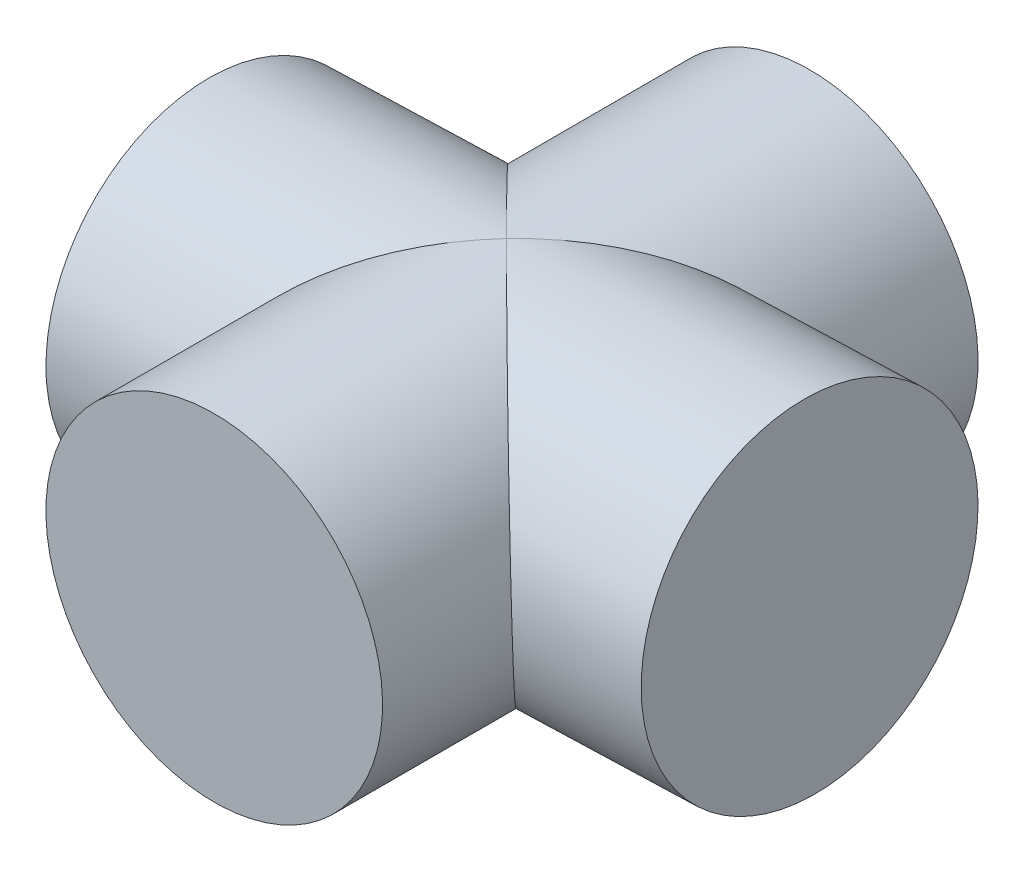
ISO-10303-21;
HEADER;
FILE_DESCRIPTION(('STEP AP214'),'2;1');
FILE_NAME('part.step','',(''),(''),'','','');
FILE_SCHEMA(('AUTOMOTIVE_DESIGN { 1 0 10303 214 1 1 1 1 }'));
ENDSEC;
DATA;
#1=APPLICATION_CONTEXT('core data for automotive mechanical design processes');
#2=APPLICATION_PROTOCOL_DEFINITION('international standard','automotive_design',2000,#1);
#3=PRODUCT_CONTEXT('',#1,'mechanical');
#4=PRODUCT('Part','Part','',(#3));
#5=PRODUCT_RELATED_PRODUCT_CATEGORY('part','',(#4));
#6=PRODUCT_DEFINITION_FORMATION('','',#4);
#7=PRODUCT_DEFINITION_CONTEXT('part definition',#1,'design');
#8=PRODUCT_DEFINITION('design','',#6,#7);
#9=PRODUCT_DEFINITION_SHAPE('','',#8);
#10=(LENGTH_UNIT() NAMED_UNIT(*) SI_UNIT(.MILLI.,.METRE.));
#11=(NAMED_UNIT(*) PLANE_ANGLE_UNIT() SI_UNIT($,.RADIAN.));
#12=(NAMED_UNIT(*) SI_UNIT($,.STERADIAN.) SOLID_ANGLE_UNIT());
#13=UNCERTAINTY_MEASURE_WITH_UNIT(LENGTH_MEASURE(1.E-05),#10,'distance_accuracy_value','');
#14=(GEOMETRIC_REPRESENTATION_CONTEXT(3) GLOBAL_UNCERTAINTY_ASSIGNED_CONTEXT((#13)) GLOBAL_UNIT_ASSIGNED_CONTEXT((#10,
#11,#12)) REPRESENTATION_CONTEXT('',''));
#15=CARTESIAN_POINT('',(0.,0.,0.));
#16=DIRECTION('',(0.,0.,1.));
#17=DIRECTION('',(1.,0.,0.));
#18=AXIS2_PLACEMENT_3D('',#15,#16,#17);
#19=CARTESIAN_POINT('',(8.99728163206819,-776.108673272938,37.6201291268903));
#20=DIRECTION('',(-0.999465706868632,-0.0326848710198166,-7.07598383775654E-08));
#21=DIRECTION('',(-7.07976652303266E-08,0.,0.999999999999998));
#22=AXIS2_PLACEMENT_3D('',#19,#20,#21);
#23=CYLINDRICAL_SURFACE('',#22,6.5);
#24=DIRECTION('',(-0.999465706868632,-0.0326848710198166,-7.07598383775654E-08));
#25=VECTOR('',#24,1.);
#26=CARTESIAN_POINT('',(8.99728117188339,-776.108673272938,44.1201291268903));
#27=LINE('',#26,#25);
#28=CARTESIAN_POINT('',(8.99728117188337,-776.108673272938,44.1201291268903));
#29=VERTEX_POINT('',#28);
#30=CARTESIAN_POINT('',(6.49861690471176,-776.190385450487,44.1201289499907));
#31=VERTEX_POINT('',#30);
#32=EDGE_CURVE('E95',#29,#31,#27,.T.);
#33=ORIENTED_EDGE('',*,*,#32,.F.);
#34=ORIENTED_EDGE('',*,*,#32,.T.);
#35=CARTESIAN_POINT('',(0.21454193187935,-782.899364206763,37.6201285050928));
#36=CARTESIAN_POINT('',(4.02011912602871,-782.77491290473,41.4277406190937));
#37=CARTESIAN_POINT('',(6.62306820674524,-779.995962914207,44.1201289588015));
#38=CARTESIAN_POINT('',(6.49861690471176,-776.190385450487,44.1201289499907));
#39=(BOUNDED_CURVE() B_SPLINE_CURVE(3,(#35,#36,#37,#38),.UNSPECIFIED.,.F.,
.F.) B_SPLINE_CURVE_WITH_KNOTS((4,4),(1.5707963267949,3.1415926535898),
.UNSPECIFIED.) CURVE() GEOMETRIC_REPRESENTATION_ITEM() RATIONAL_B_SPLINE_CURVE((1.,
0.804737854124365,0.804737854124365,1.)) REPRESENTATION_ITEM(''));
#40=CARTESIAN_POINT('',(0.21454193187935,-782.899364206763,37.6201285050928));
#41=VERTEX_POINT('',#40);
#42=EDGE_CURVE('E87',#41,#31,#39,.T.);
#43=ORIENTED_EDGE('',*,*,#42,.F.);
#44=CARTESIAN_POINT('',(6.49861782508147,-776.190385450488,31.1201289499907));
#45=CARTESIAN_POINT('',(6.62306912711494,-779.995962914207,31.1201289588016));
#46=CARTESIAN_POINT('',(4.02011966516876,-782.774912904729,33.8125169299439));
#47=CARTESIAN_POINT('',(0.21454193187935,-782.899364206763,37.6201285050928));
#48=(BOUNDED_CURVE() B_SPLINE_CURVE(3,(#44,#45,#46,#47),.UNSPECIFIED.,.F.,
.F.) B_SPLINE_CURVE_WITH_KNOTS((4,4),(3.1415926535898,4.71238898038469),
.UNSPECIFIED.) CURVE() GEOMETRIC_REPRESENTATION_ITEM() RATIONAL_B_SPLINE_CURVE((1.,
0.804737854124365,0.804737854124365,1.)) REPRESENTATION_ITEM(''));
#49=CARTESIAN_POINT('',(6.49861782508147,-776.190385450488,31.1201289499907));
#50=VERTEX_POINT('',#49);
#51=EDGE_CURVE('E66',#50,#41,#48,.T.);
#52=ORIENTED_EDGE('',*,*,#51,.F.);
#53=DIRECTION('',(-0.999465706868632,-0.0326848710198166,-7.07598383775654E-08));
#54=VECTOR('',#53,1.);
#55=CARTESIAN_POINT('',(8.99728209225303,-776.108673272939,31.1201291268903));
#56=LINE('',#55,#54);
#57=CARTESIAN_POINT('',(8.99728209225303,-776.108673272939,31.1201291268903));
#58=VERTEX_POINT('',#57);
#59=EDGE_CURVE('E101',#58,#50,#56,.T.);
#60=ORIENTED_EDGE('',*,*,#59,.F.);
#61=ORIENTED_EDGE('',*,*,#59,.T.);
#62=CARTESIAN_POINT('',(-0.210361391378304,-769.90631001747,37.6201284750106));
#63=CARTESIAN_POINT('',(3.59521634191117,-769.781858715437,33.8125168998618));
#64=CARTESIAN_POINT('',(6.37416652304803,-772.384807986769,31.1201289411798));
#65=CARTESIAN_POINT('',(6.49861782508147,-776.190385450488,31.1201289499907));
#66=(BOUNDED_CURVE() B_SPLINE_CURVE(3,(#62,#63,#64,#65),.UNSPECIFIED.,.F.,
.F.) B_SPLINE_CURVE_WITH_KNOTS((4,4),(1.5707963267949,3.1415926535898),
.UNSPECIFIED.) CURVE() GEOMETRIC_REPRESENTATION_ITEM() RATIONAL_B_SPLINE_CURVE((1.,
0.804737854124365,0.804737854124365,1.)) REPRESENTATION_ITEM(''));
#67=CARTESIAN_POINT('',(-0.210361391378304,-769.90631001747,37.6201284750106));
#68=VERTEX_POINT('',#67);
#69=EDGE_CURVE('E82',#68,#50,#66,.T.);
#70=ORIENTED_EDGE('',*,*,#69,.F.);
#71=CARTESIAN_POINT('',(6.49861690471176,-776.190385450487,44.1201289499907));
#72=CARTESIAN_POINT('',(6.37416560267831,-772.384807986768,44.1201289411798));
#73=CARTESIAN_POINT('',(3.59521580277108,-769.781858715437,41.4277405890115));
#74=CARTESIAN_POINT('',(-0.210361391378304,-769.90631001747,37.6201284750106));
#75=(BOUNDED_CURVE() B_SPLINE_CURVE(3,(#71,#72,#73,#74),.UNSPECIFIED.,.F.,
.F.) B_SPLINE_CURVE_WITH_KNOTS((4,4),(3.1415926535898,4.71238898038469),
.UNSPECIFIED.) CURVE() GEOMETRIC_REPRESENTATION_ITEM() RATIONAL_B_SPLINE_CURVE((1.,
0.804737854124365,0.804737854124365,1.)) REPRESENTATION_ITEM(''));
#76=EDGE_CURVE('E104',#31,#68,#75,.T.);
#77=ORIENTED_EDGE('',*,*,#76,.F.);
#78=EDGE_LOOP('',(#33,#34,#43,#52,#60,#61,#70,#77));
#79=FACE_BOUND('',#78,.T.);
#80=CARTESIAN_POINT('',(11.4959458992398,-776.026961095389,37.6201293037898));
#81=DIRECTION('',(-0.999465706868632,-0.0326848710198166,-7.07598383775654E-08));
#82=DIRECTION('',(0.00225670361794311,-0.0690095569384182,0.997613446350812));
#83=AXIS2_PLACEMENT_3D('',#80,#81,#82);
#84=CIRCLE('',#83,6.5);
#85=CARTESIAN_POINT('',(11.5106144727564,-776.475523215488,44.1046167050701));
#86=VERTEX_POINT('',#85);
#87=EDGE_CURVE('E110',#86,#86,#84,.T.);
#88=ORIENTED_EDGE('',*,*,#87,.T.);
#89=EDGE_LOOP('',(#88));
#90=FACE_BOUND('',#89,.T.);
#91=ADVANCED_FACE('F16',(#79,#90),#23,.T.);
#92=CARTESIAN_POINT('',(0.00208963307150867,-776.402837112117,46.6201284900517));
#93=DIRECTION('',(7.07976683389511E-08,0.,-0.999999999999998));
#94=DIRECTION('',(-0.999465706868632,-0.0326848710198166,-7.07598419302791E-08));
#95=AXIS2_PLACEMENT_3D('',#92,#93,#94);
#96=CYLINDRICAL_SURFACE('',#95,6.5);
#97=ORIENTED_EDGE('',*,*,#69,.T.);
#98=DIRECTION('',(7.07976683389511E-08,0.,-0.999999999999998));
#99=VECTOR('',#98,1.);
#100=CARTESIAN_POINT('',(6.49861672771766,-776.190385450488,46.6201289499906));
#101=LINE('',#100,#99);
#102=CARTESIAN_POINT('',(6.49861800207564,-776.190385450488,28.6201289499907));
#103=VERTEX_POINT('',#102);
#104=EDGE_CURVE('E20',#50,#103,#101,.T.);
#105=ORIENTED_EDGE('',*,*,#104,.T.);
#106=ORIENTED_EDGE('',*,*,#104,.F.);
#107=ORIENTED_EDGE('',*,*,#51,.T.);
#108=CARTESIAN_POINT('',(0.21454193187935,-782.899364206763,37.6201285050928));
#109=CARTESIAN_POINT('',(-3.59103526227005,-783.023815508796,33.812516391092));
#110=CARTESIAN_POINT('',(-6.36998506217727,-780.420866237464,31.1201280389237));
#111=CARTESIAN_POINT('',(-6.49443636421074,-776.615288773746,31.1201280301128));
#112=(BOUNDED_CURVE() B_SPLINE_CURVE(3,(#108,#109,#110,#111),.UNSPECIFIED.,.F.,
.F.) B_SPLINE_CURVE_WITH_KNOTS((4,4),(4.71238898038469,6.28318530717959),
.UNSPECIFIED.) CURVE() GEOMETRIC_REPRESENTATION_ITEM() RATIONAL_B_SPLINE_CURVE((1.,
0.804737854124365,0.804737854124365,1.)) REPRESENTATION_ITEM(''));
#113=CARTESIAN_POINT('',(-6.49443636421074,-776.615288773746,31.1201280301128));
#114=VERTEX_POINT('',#113);
#115=EDGE_CURVE('E27',#41,#114,#112,.T.);
#116=ORIENTED_EDGE('',*,*,#115,.T.);
#117=DIRECTION('',(7.07976683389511E-08,0.,-0.999999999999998));
#118=VECTOR('',#117,1.);
#119=CARTESIAN_POINT('',(-6.49443746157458,-776.615288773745,46.6201280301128));
#120=LINE('',#119,#118);
#121=CARTESIAN_POINT('',(-6.49443618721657,-776.615288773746,28.6201280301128));
#122=VERTEX_POINT('',#121);
#123=EDGE_CURVE('E147',#114,#122,#120,.T.);
#124=ORIENTED_EDGE('',*,*,#123,.T.);
#125=ORIENTED_EDGE('',*,*,#123,.F.);
#126=CARTESIAN_POINT('',(-6.49443636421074,-776.615288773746,31.1201280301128));
#127=CARTESIAN_POINT('',(-6.61888766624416,-772.809711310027,31.1201280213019));
#128=CARTESIAN_POINT('',(-4.01593858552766,-770.030761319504,33.8125163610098));
#129=CARTESIAN_POINT('',(-0.210361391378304,-769.90631001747,37.6201284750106));
#130=(BOUNDED_CURVE() B_SPLINE_CURVE(3,(#126,#127,#128,#129),.UNSPECIFIED.,.F.,
.F.) B_SPLINE_CURVE_WITH_KNOTS((4,4),(0.,1.5707963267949),
.UNSPECIFIED.) CURVE() GEOMETRIC_REPRESENTATION_ITEM() RATIONAL_B_SPLINE_CURVE((1.,
0.804737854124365,0.804737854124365,1.)) REPRESENTATION_ITEM(''));
#131=EDGE_CURVE('E145',#114,#68,#130,.T.);
#132=ORIENTED_EDGE('',*,*,#131,.T.);
#133=EDGE_LOOP('',(#97,#105,#106,#107,#116,#124,#125,#132));
#134=FACE_BOUND('',#133,.T.);
#135=CARTESIAN_POINT('',(0.00209108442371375,-776.402837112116,26.1201284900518));
#136=DIRECTION('',(-7.07976683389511E-08,0.,0.999999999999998));
#137=DIRECTION('',(0.999465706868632,0.0326848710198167,7.07598419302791E-08));
#138=AXIS2_PLACEMENT_3D('',#135,#136,#137);
#139=CIRCLE('',#138,6.5);
#140=CARTESIAN_POINT('',(6.49861817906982,-776.190385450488,26.1201289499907));
#141=VERTEX_POINT('',#140);
#142=EDGE_CURVE('E188',#141,#141,#139,.T.);
#143=ORIENTED_EDGE('',*,*,#142,.T.);
#144=EDGE_LOOP('',(#143));
#145=FACE_BOUND('',#144,.T.);
#146=ADVANCED_FACE('F18',(#134,#145),#96,.T.);
#147=CARTESIAN_POINT('',(8.99728163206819,-776.108673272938,37.6201291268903));
#148=DIRECTION('',(-0.999465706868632,-0.0326848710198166,-7.07598383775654E-08));
#149=DIRECTION('',(-7.07976652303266E-08,0.,0.999999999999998));
#150=AXIS2_PLACEMENT_3D('',#147,#148,#149);
#151=CYLINDRICAL_SURFACE('',#150,6.5);
#152=ORIENTED_EDGE('',*,*,#131,.F.);
#153=DIRECTION('',(-0.999465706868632,-0.0326848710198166,-7.07598383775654E-08));
#154=VECTOR('',#153,1.);
#155=CARTESIAN_POINT('',(8.99728209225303,-776.108673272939,31.1201291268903));
#156=LINE('',#155,#154);
#157=CARTESIAN_POINT('',(-8.99310063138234,-776.697000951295,31.1201278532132));
#158=VERTEX_POINT('',#157);
#159=EDGE_CURVE('E173',#114,#158,#156,.T.);
#160=ORIENTED_EDGE('',*,*,#159,.T.);
#161=ORIENTED_EDGE('',*,*,#159,.F.);
#162=ORIENTED_EDGE('',*,*,#115,.F.);
#163=CARTESIAN_POINT('',(-6.49443728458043,-776.615288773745,44.1201280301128));
#164=CARTESIAN_POINT('',(-6.36998598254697,-780.420866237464,44.1201280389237));
#165=CARTESIAN_POINT('',(-3.59103580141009,-783.023815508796,41.4277400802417));
#166=CARTESIAN_POINT('',(0.21454193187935,-782.899364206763,37.6201285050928));
#167=(BOUNDED_CURVE() B_SPLINE_CURVE(3,(#163,#164,#165,#166),.UNSPECIFIED.,.F.,
.F.) B_SPLINE_CURVE_WITH_KNOTS((4,4),(0.,1.5707963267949),
.UNSPECIFIED.) CURVE() GEOMETRIC_REPRESENTATION_ITEM() RATIONAL_B_SPLINE_CURVE((1.,
0.804737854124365,0.804737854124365,1.)) REPRESENTATION_ITEM(''));
#168=CARTESIAN_POINT('',(-6.49443728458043,-776.615288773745,44.1201280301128));
#169=VERTEX_POINT('',#168);
#170=EDGE_CURVE('E10',#169,#41,#167,.T.);
#171=ORIENTED_EDGE('',*,*,#170,.F.);
#172=DIRECTION('',(-0.999465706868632,-0.0326848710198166,-7.07598383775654E-08));
#173=VECTOR('',#172,1.);
#174=CARTESIAN_POINT('',(8.99728117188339,-776.108673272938,44.1201291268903));
#175=LINE('',#174,#173);
#176=CARTESIAN_POINT('',(-8.993101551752,-776.697000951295,44.1201278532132));
#177=VERTEX_POINT('',#176);
#178=EDGE_CURVE('E56',#169,#177,#175,.T.);
#179=ORIENTED_EDGE('',*,*,#178,.T.);
#180=ORIENTED_EDGE('',*,*,#178,.F.);
#181=CARTESIAN_POINT('',(-0.210361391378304,-769.90631001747,37.6201284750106));
#182=CARTESIAN_POINT('',(-4.01593912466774,-770.030761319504,41.4277400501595));
#183=CARTESIAN_POINT('',(-6.6188885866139,-772.809711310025,44.1201280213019));
#184=CARTESIAN_POINT('',(-6.49443728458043,-776.615288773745,44.1201280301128));
#185=(BOUNDED_CURVE() B_SPLINE_CURVE(3,(#181,#182,#183,#184),.UNSPECIFIED.,.F.,
.F.) B_SPLINE_CURVE_WITH_KNOTS((4,4),(4.71238898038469,6.28318530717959),
.UNSPECIFIED.) CURVE() GEOMETRIC_REPRESENTATION_ITEM() RATIONAL_B_SPLINE_CURVE((1.,
0.804737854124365,0.804737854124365,1.)) REPRESENTATION_ITEM(''));
#186=EDGE_CURVE('E107',#68,#169,#185,.T.);
#187=ORIENTED_EDGE('',*,*,#186,.F.);
#188=EDGE_LOOP('',(#152,#160,#161,#162,#171,#179,#180,#187));
#189=FACE_BOUND('',#188,.T.);
#190=CARTESIAN_POINT('',(-11.4917653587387,-776.778713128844,37.6201276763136));
#191=DIRECTION('',(-0.999465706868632,-0.0326848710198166,-7.07598383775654E-08));
#192=DIRECTION('',(0.00225670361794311,-0.0690095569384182,0.997613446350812));
#193=AXIS2_PLACEMENT_3D('',#190,#191,#192);
#194=CIRCLE('',#193,6.5);
#195=CARTESIAN_POINT('',(-11.4770967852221,-777.227275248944,44.1046150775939));
#196=VERTEX_POINT('',#195);
#197=EDGE_CURVE('E115',#196,#196,#194,.T.);
#198=ORIENTED_EDGE('',*,*,#197,.F.);
#199=EDGE_LOOP('',(#198));
#200=FACE_BOUND('',#199,.T.);
#201=ADVANCED_FACE('F198',(#189,#200),#151,.T.);
#202=CARTESIAN_POINT('',(0.00208963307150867,-776.402837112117,46.6201284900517));
#203=DIRECTION('',(7.07976683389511E-08,0.,-0.999999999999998));
#204=DIRECTION('',(-0.999465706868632,-0.0326848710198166,-7.07598419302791E-08));
#205=AXIS2_PLACEMENT_3D('',#202,#203,#204);
#206=CYLINDRICAL_SURFACE('',#205,6.5);
#207=DIRECTION('',(7.07976683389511E-08,0.,-0.999999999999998));
#208=VECTOR('',#207,1.);
#209=CARTESIAN_POINT('',(-6.49443746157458,-776.615288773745,46.6201280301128));
#210=LINE('',#209,#208);
#211=CARTESIAN_POINT('',(-6.49443746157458,-776.615288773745,46.6201280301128));
#212=VERTEX_POINT('',#211);
#213=EDGE_CURVE('E141',#212,#169,#210,.T.);
#214=ORIENTED_EDGE('',*,*,#213,.F.);
#215=ORIENTED_EDGE('',*,*,#213,.T.);
#216=ORIENTED_EDGE('',*,*,#170,.T.);
#217=ORIENTED_EDGE('',*,*,#42,.T.);
#218=DIRECTION('',(7.07976683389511E-08,0.,-0.999999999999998));
#219=VECTOR('',#218,1.);
#220=CARTESIAN_POINT('',(6.49861672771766,-776.190385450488,46.6201289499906));
#221=LINE('',#220,#219);
#222=CARTESIAN_POINT('',(6.49861672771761,-776.190385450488,46.6201289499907));
#223=VERTEX_POINT('',#222);
#224=EDGE_CURVE('E93',#223,#31,#221,.T.);
#225=ORIENTED_EDGE('',*,*,#224,.F.);
#226=ORIENTED_EDGE('',*,*,#224,.T.);
#227=ORIENTED_EDGE('',*,*,#76,.T.);
#228=ORIENTED_EDGE('',*,*,#186,.T.);
#229=EDGE_LOOP('',(#214,#215,#216,#217,#225,#226,#227,#228));
#230=FACE_BOUND('',#229,.T.);
#231=CARTESIAN_POINT('',(0.00208945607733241,-776.402837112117,49.1201284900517));
#232=DIRECTION('',(-7.07976683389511E-08,0.,0.999999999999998));
#233=DIRECTION('',(0.999465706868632,0.0326848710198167,7.07598419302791E-08));
#234=AXIS2_PLACEMENT_3D('',#231,#232,#233);
#235=CIRCLE('',#234,6.5);
#236=CARTESIAN_POINT('',(6.49861655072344,-776.190385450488,49.1201289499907));
#237=VERTEX_POINT('',#236);
#238=EDGE_CURVE('E191',#237,#237,#235,.T.);
#239=ORIENTED_EDGE('',*,*,#238,.F.);
#240=EDGE_LOOP('',(#239));
#241=FACE_BOUND('',#240,.T.);
#242=ADVANCED_FACE('F89',(#230,#241),#206,.T.);
#243=CARTESIAN_POINT('',(11.4959458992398,-776.026961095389,37.6201293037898));
#244=DIRECTION('',(-0.999465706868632,-0.0326848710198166,-7.07598383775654E-08));
#245=DIRECTION('',(0.00225670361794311,-0.0690095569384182,0.997613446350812));
#246=AXIS2_PLACEMENT_3D('',#243,#244,#245);
#247=PLANE('',#246);
#248=ORIENTED_EDGE('',*,*,#87,.F.);
#249=EDGE_LOOP('',(#248));
#250=FACE_BOUND('',#249,.T.);
#251=ADVANCED_FACE('F197',(#250),#247,.F.);
#252=CARTESIAN_POINT('',(-11.4917653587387,-776.778713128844,37.6201276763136));
#253=DIRECTION('',(-0.999465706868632,-0.0326848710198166,-7.07598383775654E-08));
#254=DIRECTION('',(0.00225670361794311,-0.0690095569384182,0.997613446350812));
#255=AXIS2_PLACEMENT_3D('',#252,#253,#254);
#256=PLANE('',#255);
#257=ORIENTED_EDGE('',*,*,#197,.T.);
#258=EDGE_LOOP('',(#257));
#259=FACE_BOUND('',#258,.T.);
#260=ADVANCED_FACE('F204',(#259),#256,.T.);
#261=CARTESIAN_POINT('',(0.00209108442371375,-776.402837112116,26.1201284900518));
#262=DIRECTION('',(-7.07976683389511E-08,0.,0.999999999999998));
#263=DIRECTION('',(0.999465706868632,0.0326848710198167,7.07598419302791E-08));
#264=AXIS2_PLACEMENT_3D('',#261,#262,#263);
#265=PLANE('',#264);
#266=ORIENTED_EDGE('',*,*,#142,.F.);
#267=EDGE_LOOP('',(#266));
#268=FACE_BOUND('',#267,.T.);
#269=ADVANCED_FACE('F216',(#268),#265,.F.);
#270=CARTESIAN_POINT('',(0.00208945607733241,-776.402837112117,49.1201284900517));
#271=DIRECTION('',(-7.07976683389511E-08,0.,0.999999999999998));
#272=DIRECTION('',(0.999465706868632,0.0326848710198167,7.07598419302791E-08));
#273=AXIS2_PLACEMENT_3D('',#270,#271,#272);
#274=PLANE('',#273);
#275=ORIENTED_EDGE('',*,*,#238,.T.);
#276=EDGE_LOOP('',(#275));
#277=FACE_BOUND('',#276,.T.);
#278=ADVANCED_FACE('F195',(#277),#274,.T.);
#279=CLOSED_SHELL('',(#91,#146,#201,#242,#251,#260,#269,#278));
#280=MANIFOLD_SOLID_BREP('B1',#279);
#281=ADVANCED_BREP_SHAPE_REPRESENTATION('',(#18,#280),#14);
#282=SHAPE_DEFINITION_REPRESENTATION(#9,#281);
ENDSEC;
END-ISO-10303-21;
